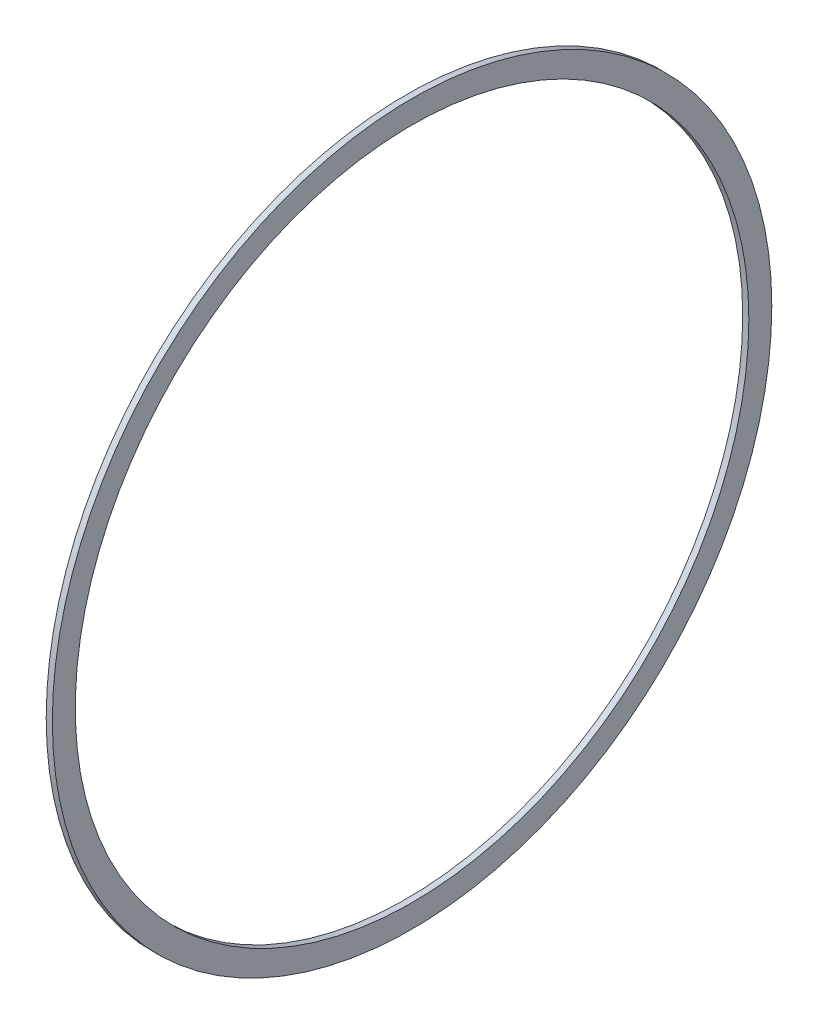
from build123d import *

# Parameters (mm, degrees)
SKETCH_1_W          = 2
SKETCH_1_H          = 117.5
SKETCH_2_R          = 110
CUT_EXTRUDE_1_DEPTH = 167.182129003


with BuildPart() as part:
    # Sketch 1 → Revolve 1 (revolve)
    with BuildSketch(Plane.XY, mode=Mode.PRIVATE) as revolve_1_sk:
        with Locations((1, 58.75)):
            Rectangle(SKETCH_1_W, SKETCH_1_H)
    revolve(revolve_1_sk.sketch.rotate(Axis((0, 0, 0), (1, 0, 0)), 90), axis=Axis((0, 0, 0), (1, 0, 0)))

    # Sketch 2 → Cut-Extrude 1 (cut, through all)
    with BuildSketch(Plane(origin=(2, 0, 0), x_dir=(0, 0, -1), z_dir=(1, 0, 0))):
        Circle(SKETCH_2_R)
    extrude(amount=-CUT_EXTRUDE_1_DEPTH, mode=Mode.SUBTRACT)


solid = part.part
